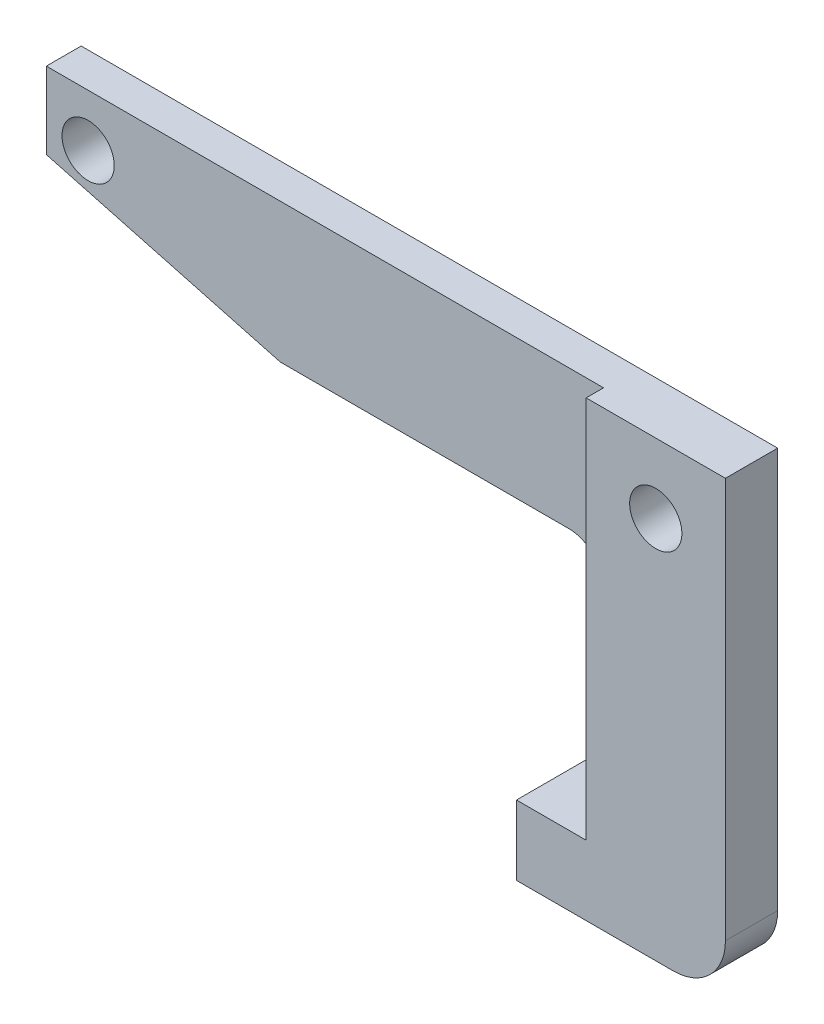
ISO-10303-21;
HEADER;
FILE_DESCRIPTION(('STEP AP214'),'2;1');
FILE_NAME('part.step','',(''),(''),'','','');
FILE_SCHEMA(('AUTOMOTIVE_DESIGN { 1 0 10303 214 1 1 1 1 }'));
ENDSEC;
DATA;
#1=APPLICATION_CONTEXT('core data for automotive mechanical design processes');
#2=APPLICATION_PROTOCOL_DEFINITION('international standard','automotive_design',2000,#1);
#3=PRODUCT_CONTEXT('',#1,'mechanical');
#4=PRODUCT('Part','Part','',(#3));
#5=PRODUCT_RELATED_PRODUCT_CATEGORY('part','',(#4));
#6=PRODUCT_DEFINITION_FORMATION('','',#4);
#7=PRODUCT_DEFINITION_CONTEXT('part definition',#1,'design');
#8=PRODUCT_DEFINITION('design','',#6,#7);
#9=PRODUCT_DEFINITION_SHAPE('','',#8);
#10=(LENGTH_UNIT() NAMED_UNIT(*) SI_UNIT(.MILLI.,.METRE.));
#11=(NAMED_UNIT(*) PLANE_ANGLE_UNIT() SI_UNIT($,.RADIAN.));
#12=(NAMED_UNIT(*) SI_UNIT($,.STERADIAN.) SOLID_ANGLE_UNIT());
#13=UNCERTAINTY_MEASURE_WITH_UNIT(LENGTH_MEASURE(1.E-05),#10,'distance_accuracy_value','');
#14=(GEOMETRIC_REPRESENTATION_CONTEXT(3) GLOBAL_UNCERTAINTY_ASSIGNED_CONTEXT((#13)) GLOBAL_UNIT_ASSIGNED_CONTEXT((#10,
#11,#12)) REPRESENTATION_CONTEXT('',''));
#15=CARTESIAN_POINT('',(0.,0.,0.));
#16=DIRECTION('',(0.,0.,1.));
#17=DIRECTION('',(1.,0.,0.));
#18=AXIS2_PLACEMENT_3D('',#15,#16,#17);
#19=CARTESIAN_POINT('',(-114.3,-12.7,0.));
#20=DIRECTION('',(0.,0.,1.));
#21=DIRECTION('',(1.,0.,0.));
#22=AXIS2_PLACEMENT_3D('',#19,#20,#21);
#23=PLANE('',#22);
#24=DIRECTION('',(0.,-1.,0.));
#25=VECTOR('',#24,1.);
#26=CARTESIAN_POINT('',(9.52499999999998,-12.7,0.));
#27=LINE('',#26,#25);
#28=CARTESIAN_POINT('',(9.52499999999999,9.52499999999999,0.));
#29=VERTEX_POINT('',#28);
#30=CARTESIAN_POINT('',(9.52499999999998,0.,0.));
#31=VERTEX_POINT('',#30);
#32=EDGE_CURVE('E153',#29,#31,#27,.T.);
#33=ORIENTED_EDGE('',*,*,#32,.T.);
#34=CARTESIAN_POINT('',(0.,0.,0.));
#35=DIRECTION('',(0.,0.,-1.));
#36=DIRECTION('',(-1.,0.,0.));
#37=AXIS2_PLACEMENT_3D('',#34,#35,#36);
#38=CIRCLE('',#37,9.525);
#39=CARTESIAN_POINT('',(0.,9.52499999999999,0.));
#40=VERTEX_POINT('',#39);
#41=EDGE_CURVE('E47',#40,#31,#38,.T.);
#42=ORIENTED_EDGE('',*,*,#41,.F.);
#43=DIRECTION('',(1.,0.,0.));
#44=VECTOR('',#43,1.);
#45=CARTESIAN_POINT('',(-114.3,9.52499999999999,0.));
#46=LINE('',#45,#44);
#47=EDGE_CURVE('E150',#40,#29,#46,.T.);
#48=ORIENTED_EDGE('',*,*,#47,.T.);
#49=EDGE_LOOP('',(#33,#42,#48));
#50=FACE_BOUND('',#49,.T.);
#51=ADVANCED_FACE('F32',(#50),#23,.F.);
#52=CARTESIAN_POINT('',(0.,0.,0.));
#53=DIRECTION('',(0.,0.,1.));
#54=DIRECTION('',(1.,0.,0.));
#55=AXIS2_PLACEMENT_3D('',#52,#53,#54);
#56=CYLINDRICAL_SURFACE('',#55,4.7625);
#57=CARTESIAN_POINT('',(0.,0.,12.7));
#58=DIRECTION('',(0.,0.,1.));
#59=DIRECTION('',(1.,0.,0.));
#60=AXIS2_PLACEMENT_3D('',#57,#58,#59);
#61=CIRCLE('',#60,4.7625);
#62=CARTESIAN_POINT('',(4.7625,0.,12.7));
#63=VERTEX_POINT('',#62);
#64=EDGE_CURVE('E213',#63,#63,#61,.T.);
#65=ORIENTED_EDGE('',*,*,#64,.T.);
#66=EDGE_LOOP('',(#65));
#67=FACE_BOUND('',#66,.T.);
#68=CARTESIAN_POINT('',(0.,0.,4.445));
#69=DIRECTION('',(0.,0.,-1.));
#70=DIRECTION('',(-1.,0.,0.));
#71=AXIS2_PLACEMENT_3D('',#68,#69,#70);
#72=CIRCLE('',#71,4.7625);
#73=CARTESIAN_POINT('',(-4.7625,0.,4.445));
#74=VERTEX_POINT('',#73);
#75=EDGE_CURVE('E36',#74,#74,#72,.F.);
#76=ORIENTED_EDGE('',*,*,#75,.F.);
#77=EDGE_LOOP('',(#76));
#78=FACE_BOUND('',#77,.T.);
#79=ADVANCED_FACE('F308',(#67,#78),#56,.F.);
#80=CARTESIAN_POINT('',(-114.3,12.7,12.7));
#81=DIRECTION('',(1.,0.,0.));
#82=DIRECTION('',(0.,0.,-1.));
#83=AXIS2_PLACEMENT_3D('',#80,#81,#82);
#84=PLANE('',#83);
#85=DIRECTION('',(0.,0.,-1.));
#86=VECTOR('',#85,1.);
#87=CARTESIAN_POINT('',(-114.3,12.7,12.7));
#88=LINE('',#87,#86);
#89=CARTESIAN_POINT('',(-114.3,12.7,9.525));
#90=VERTEX_POINT('',#89);
#91=CARTESIAN_POINT('',(-114.3,12.7,3.175));
#92=VERTEX_POINT('',#91);
#93=EDGE_CURVE('E182',#90,#92,#88,.T.);
#94=ORIENTED_EDGE('',*,*,#93,.T.);
#95=DIRECTION('',(0.,0.707106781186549,0.707106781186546));
#96=VECTOR('',#95,1.);
#97=CARTESIAN_POINT('',(-114.3,12.7,3.175));
#98=LINE('',#97,#96);
#99=CARTESIAN_POINT('',(-114.3,9.52499999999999,0.));
#100=VERTEX_POINT('',#99);
#101=EDGE_CURVE('E41',#92,#100,#98,.F.);
#102=ORIENTED_EDGE('',*,*,#101,.T.);
#103=DIRECTION('',(0.,-1.,0.));
#104=VECTOR('',#103,1.);
#105=CARTESIAN_POINT('',(-114.3,12.7,0.));
#106=LINE('',#105,#104);
#107=CARTESIAN_POINT('',(-114.3,-1.26999999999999,0.));
#108=VERTEX_POINT('',#107);
#109=EDGE_CURVE('E166',#100,#108,#106,.T.);
#110=ORIENTED_EDGE('',*,*,#109,.T.);
#111=DIRECTION('',(0.,0.,1.));
#112=VECTOR('',#111,1.);
#113=CARTESIAN_POINT('',(-114.3,-1.26999999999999,12.7));
#114=LINE('',#113,#112);
#115=CARTESIAN_POINT('',(-114.3,-1.26999999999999,9.525));
#116=VERTEX_POINT('',#115);
#117=EDGE_CURVE('E257',#108,#116,#114,.T.);
#118=ORIENTED_EDGE('',*,*,#117,.T.);
#119=DIRECTION('',(0.,-1.,0.));
#120=VECTOR('',#119,1.);
#121=CARTESIAN_POINT('',(-114.3,-12.7,9.525));
#122=LINE('',#121,#120);
#123=EDGE_CURVE('E199',#90,#116,#122,.T.);
#124=ORIENTED_EDGE('',*,*,#123,.F.);
#125=EDGE_LOOP('',(#94,#102,#110,#118,#124));
#126=FACE_BOUND('',#125,.T.);
#127=ADVANCED_FACE('F34',(#126),#84,.F.);
#128=CARTESIAN_POINT('',(-114.3,-12.7,12.7));
#129=DIRECTION('',(0.,1.,0.));
#130=DIRECTION('',(0.,0.,1.));
#131=AXIS2_PLACEMENT_3D('',#128,#129,#130);
#132=PLANE('',#131);
#133=DIRECTION('',(1.,0.,0.));
#134=VECTOR('',#133,1.);
#135=CARTESIAN_POINT('',(-114.3,-12.7,0.));
#136=LINE('',#135,#134);
#137=CARTESIAN_POINT('',(-71.6426592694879,-12.7,0.));
#138=VERTEX_POINT('',#137);
#139=CARTESIAN_POINT('',(-19.05,-12.7,0.));
#140=VERTEX_POINT('',#139);
#141=EDGE_CURVE('E217',#138,#140,#136,.T.);
#142=ORIENTED_EDGE('',*,*,#141,.T.);
#143=DIRECTION('',(0.,0.,-1.));
#144=VECTOR('',#143,1.);
#145=CARTESIAN_POINT('',(-19.05,-12.7,9.525));
#146=LINE('',#145,#144);
#147=CARTESIAN_POINT('',(-19.05,-12.7,9.525));
#148=VERTEX_POINT('',#147);
#149=EDGE_CURVE('E272',#140,#148,#146,.F.);
#150=ORIENTED_EDGE('',*,*,#149,.T.);
#151=DIRECTION('',(1.,0.,0.));
#152=VECTOR('',#151,1.);
#153=CARTESIAN_POINT('',(-12.7,-12.7,9.525));
#154=LINE('',#153,#152);
#155=CARTESIAN_POINT('',(-71.642659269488,-12.7,9.525));
#156=VERTEX_POINT('',#155);
#157=EDGE_CURVE('E201',#156,#148,#154,.T.);
#158=ORIENTED_EDGE('',*,*,#157,.F.);
#159=DIRECTION('',(0.,0.,-1.));
#160=VECTOR('',#159,1.);
#161=CARTESIAN_POINT('',(-71.6426592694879,-12.7,12.7));
#162=LINE('',#161,#160);
#163=EDGE_CURVE('E253',#156,#138,#162,.T.);
#164=ORIENTED_EDGE('',*,*,#163,.T.);
#165=EDGE_LOOP('',(#142,#150,#158,#164));
#166=FACE_BOUND('',#165,.T.);
#167=ADVANCED_FACE('F335',(#166),#132,.F.);
#168=CARTESIAN_POINT('',(-106.68,3.175,0.));
#169=DIRECTION('',(0.,0.,1.));
#170=DIRECTION('',(1.,0.,0.));
#171=AXIS2_PLACEMENT_3D('',#168,#169,#170);
#172=CYLINDRICAL_SURFACE('',#171,4.7625);
#173=CARTESIAN_POINT('',(-106.68,3.175,0.));
#174=DIRECTION('',(0.,0.,1.));
#175=DIRECTION('',(1.,0.,0.));
#176=AXIS2_PLACEMENT_3D('',#173,#174,#175);
#177=CIRCLE('',#176,4.7625);
#178=CARTESIAN_POINT('',(-101.9175,3.175,0.));
#179=VERTEX_POINT('',#178);
#180=EDGE_CURVE('E210',#179,#179,#177,.T.);
#181=ORIENTED_EDGE('',*,*,#180,.F.);
#182=EDGE_LOOP('',(#181));
#183=FACE_BOUND('',#182,.T.);
#184=CARTESIAN_POINT('',(-106.68,3.175,9.525));
#185=DIRECTION('',(0.,0.,1.));
#186=DIRECTION('',(1.,0.,0.));
#187=AXIS2_PLACEMENT_3D('',#184,#185,#186);
#188=CIRCLE('',#187,4.7625);
#189=CARTESIAN_POINT('',(-101.9175,3.175,9.525));
#190=VERTEX_POINT('',#189);
#191=EDGE_CURVE('E207',#190,#190,#188,.F.);
#192=ORIENTED_EDGE('',*,*,#191,.F.);
#193=EDGE_LOOP('',(#192));
#194=FACE_BOUND('',#193,.T.);
#195=ADVANCED_FACE('F331',(#183,#194),#172,.F.);
#196=CARTESIAN_POINT('',(-71.6426592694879,-12.7,12.7));
#197=DIRECTION('',(0.258819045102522,0.965925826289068,0.));
#198=DIRECTION('',(-0.965925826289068,0.258819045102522,0.));
#199=AXIS2_PLACEMENT_3D('',#196,#197,#198);
#200=PLANE('',#199);
#201=ORIENTED_EDGE('',*,*,#163,.F.);
#202=DIRECTION('',(0.965925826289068,-0.258819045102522,0.));
#203=VECTOR('',#202,1.);
#204=CARTESIAN_POINT('',(-71.6426592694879,-12.7,9.525));
#205=LINE('',#204,#203);
#206=EDGE_CURVE('E259',#156,#116,#205,.F.);
#207=ORIENTED_EDGE('',*,*,#206,.T.);
#208=ORIENTED_EDGE('',*,*,#117,.F.);
#209=DIRECTION('',(0.965925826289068,-0.258819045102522,0.));
#210=VECTOR('',#209,1.);
#211=CARTESIAN_POINT('',(-71.6426592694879,-12.7,0.));
#212=LINE('',#211,#210);
#213=EDGE_CURVE('E255',#138,#108,#212,.F.);
#214=ORIENTED_EDGE('',*,*,#213,.F.);
#215=EDGE_LOOP('',(#201,#207,#208,#214));
#216=FACE_BOUND('',#215,.T.);
#217=ADVANCED_FACE('F334',(#216),#200,.F.);
#218=CARTESIAN_POINT('',(-12.7,-12.7,12.7));
#219=DIRECTION('',(1.,0.,0.));
#220=DIRECTION('',(0.,1.,0.));
#221=AXIS2_PLACEMENT_3D('',#218,#219,#220);
#222=PLANE('',#221);
#223=DIRECTION('',(0.,1.,0.));
#224=VECTOR('',#223,1.);
#225=CARTESIAN_POINT('',(-12.7,-12.7,9.525));
#226=LINE('',#225,#224);
#227=CARTESIAN_POINT('',(-12.7,-19.05,9.525));
#228=VERTEX_POINT('',#227);
#229=CARTESIAN_POINT('',(-12.7,12.7,9.525));
#230=VERTEX_POINT('',#229);
#231=EDGE_CURVE('E188',#228,#230,#226,.T.);
#232=ORIENTED_EDGE('',*,*,#231,.F.);
#233=DIRECTION('',(0.,0.,-1.));
#234=VECTOR('',#233,1.);
#235=CARTESIAN_POINT('',(-12.7,-19.05,0.));
#236=LINE('',#235,#234);
#237=CARTESIAN_POINT('',(-12.7,-19.05,0.));
#238=VERTEX_POINT('',#237);
#239=EDGE_CURVE('E269',#228,#238,#236,.T.);
#240=ORIENTED_EDGE('',*,*,#239,.T.);
#241=DIRECTION('',(0.,-1.,0.));
#242=VECTOR('',#241,1.);
#243=CARTESIAN_POINT('',(-12.7,-12.7,0.));
#244=LINE('',#243,#242);
#245=CARTESIAN_POINT('',(-12.7,-57.15,0.));
#246=VERTEX_POINT('',#245);
#247=EDGE_CURVE('E220',#238,#246,#244,.T.);
#248=ORIENTED_EDGE('',*,*,#247,.T.);
#249=DIRECTION('',(0.,0.,-1.));
#250=VECTOR('',#249,1.);
#251=CARTESIAN_POINT('',(-12.7,-57.15,12.7));
#252=LINE('',#251,#250);
#253=CARTESIAN_POINT('',(-12.7,-57.15,12.7));
#254=VERTEX_POINT('',#253);
#255=EDGE_CURVE('E250',#254,#246,#252,.T.);
#256=ORIENTED_EDGE('',*,*,#255,.F.);
#257=DIRECTION('',(0.,-1.,0.));
#258=VECTOR('',#257,1.);
#259=CARTESIAN_POINT('',(-12.7,-12.7,12.7));
#260=LINE('',#259,#258);
#261=CARTESIAN_POINT('',(-12.7,12.7,12.7));
#262=VERTEX_POINT('',#261);
#263=EDGE_CURVE('E227',#262,#254,#260,.T.);
#264=ORIENTED_EDGE('',*,*,#263,.F.);
#265=DIRECTION('',(0.,0.,1.));
#266=VECTOR('',#265,1.);
#267=CARTESIAN_POINT('',(-12.7,12.7,9.525));
#268=LINE('',#267,#266);
#269=EDGE_CURVE('E204',#230,#262,#268,.T.);
#270=ORIENTED_EDGE('',*,*,#269,.F.);
#271=EDGE_LOOP('',(#232,#240,#248,#256,#264,#270));
#272=FACE_BOUND('',#271,.T.);
#273=ADVANCED_FACE('F343',(#272),#222,.F.);
#274=CARTESIAN_POINT('',(-12.7,-57.15,12.7));
#275=DIRECTION('',(0.,-1.,0.));
#276=DIRECTION('',(0.,0.,-1.));
#277=AXIS2_PLACEMENT_3D('',#274,#275,#276);
#278=PLANE('',#277);
#279=DIRECTION('',(-1.,0.,0.));
#280=VECTOR('',#279,1.);
#281=CARTESIAN_POINT('',(-12.7,-57.15,0.));
#282=LINE('',#281,#280);
#283=CARTESIAN_POINT('',(-25.4,-57.15,0.));
#284=VERTEX_POINT('',#283);
#285=EDGE_CURVE('E222',#246,#284,#282,.T.);
#286=ORIENTED_EDGE('',*,*,#285,.T.);
#287=DIRECTION('',(0.,0.,-1.));
#288=VECTOR('',#287,1.);
#289=CARTESIAN_POINT('',(-25.4,-57.15,12.7));
#290=LINE('',#289,#288);
#291=CARTESIAN_POINT('',(-25.4,-57.15,12.7));
#292=VERTEX_POINT('',#291);
#293=EDGE_CURVE('E247',#292,#284,#290,.T.);
#294=ORIENTED_EDGE('',*,*,#293,.F.);
#295=DIRECTION('',(-1.,0.,0.));
#296=VECTOR('',#295,1.);
#297=CARTESIAN_POINT('',(-12.7,-57.15,12.7));
#298=LINE('',#297,#296);
#299=EDGE_CURVE('E229',#254,#292,#298,.T.);
#300=ORIENTED_EDGE('',*,*,#299,.F.);
#301=ORIENTED_EDGE('',*,*,#255,.T.);
#302=EDGE_LOOP('',(#286,#294,#300,#301));
#303=FACE_BOUND('',#302,.T.);
#304=ADVANCED_FACE('F391',(#303),#278,.F.);
#305=CARTESIAN_POINT('',(-25.4,-57.15,12.7));
#306=DIRECTION('',(1.,0.,0.));
#307=DIRECTION('',(0.,1.,0.));
#308=AXIS2_PLACEMENT_3D('',#305,#306,#307);
#309=PLANE('',#308);
#310=DIRECTION('',(0.,-1.,0.));
#311=VECTOR('',#310,1.);
#312=CARTESIAN_POINT('',(-25.4,-57.15,0.));
#313=LINE('',#312,#311);
#314=CARTESIAN_POINT('',(-25.4,-66.675,0.));
#315=VERTEX_POINT('',#314);
#316=EDGE_CURVE('E224',#284,#315,#313,.T.);
#317=ORIENTED_EDGE('',*,*,#316,.T.);
#318=DIRECTION('',(0.,0.707106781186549,-0.707106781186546));
#319=VECTOR('',#318,1.);
#320=CARTESIAN_POINT('',(-25.4,-69.85,3.175));
#321=LINE('',#320,#319);
#322=CARTESIAN_POINT('',(-25.4,-69.85,3.175));
#323=VERTEX_POINT('',#322);
#324=EDGE_CURVE('E174',#315,#323,#321,.F.);
#325=ORIENTED_EDGE('',*,*,#324,.T.);
#326=DIRECTION('',(0.,0.,-1.));
#327=VECTOR('',#326,1.);
#328=CARTESIAN_POINT('',(-25.4,-69.85,12.7));
#329=LINE('',#328,#327);
#330=CARTESIAN_POINT('',(-25.4,-69.85,12.7));
#331=VERTEX_POINT('',#330);
#332=EDGE_CURVE('E244',#331,#323,#329,.T.);
#333=ORIENTED_EDGE('',*,*,#332,.F.);
#334=DIRECTION('',(0.,-1.,0.));
#335=VECTOR('',#334,1.);
#336=CARTESIAN_POINT('',(-25.4,-57.15,12.7));
#337=LINE('',#336,#335);
#338=EDGE_CURVE('E231',#292,#331,#337,.T.);
#339=ORIENTED_EDGE('',*,*,#338,.F.);
#340=ORIENTED_EDGE('',*,*,#293,.T.);
#341=EDGE_LOOP('',(#317,#325,#333,#339,#340));
#342=FACE_BOUND('',#341,.T.);
#343=ADVANCED_FACE('F366',(#342),#309,.F.);
#344=CARTESIAN_POINT('',(12.7,-69.85,12.7));
#345=DIRECTION('',(0.,1.,0.));
#346=DIRECTION('',(-1.,0.,0.));
#347=AXIS2_PLACEMENT_3D('',#344,#345,#346);
#348=PLANE('',#347);
#349=ORIENTED_EDGE('',*,*,#332,.T.);
#350=DIRECTION('',(1.,0.,0.));
#351=VECTOR('',#350,1.);
#352=CARTESIAN_POINT('',(12.7,-69.85,3.175));
#353=LINE('',#352,#351);
#354=CARTESIAN_POINT('',(3.17500000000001,-69.85,3.175));
#355=VERTEX_POINT('',#354);
#356=EDGE_CURVE('E278',#323,#355,#353,.T.);
#357=ORIENTED_EDGE('',*,*,#356,.T.);
#358=DIRECTION('',(0.,0.,-1.));
#359=VECTOR('',#358,1.);
#360=CARTESIAN_POINT('',(3.17500000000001,-69.85,12.7));
#361=LINE('',#360,#359);
#362=CARTESIAN_POINT('',(3.17500000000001,-69.85,12.7));
#363=VERTEX_POINT('',#362);
#364=EDGE_CURVE('E265',#355,#363,#361,.F.);
#365=ORIENTED_EDGE('',*,*,#364,.T.);
#366=DIRECTION('',(1.,0.,0.));
#367=VECTOR('',#366,1.);
#368=CARTESIAN_POINT('',(12.7,-69.85,12.7));
#369=LINE('',#368,#367);
#370=EDGE_CURVE('E233',#331,#363,#369,.T.);
#371=ORIENTED_EDGE('',*,*,#370,.F.);
#372=EDGE_LOOP('',(#349,#357,#365,#371));
#373=FACE_BOUND('',#372,.T.);
#374=ADVANCED_FACE('F370',(#373),#348,.F.);
#375=CARTESIAN_POINT('',(12.7,12.7,12.7));
#376=DIRECTION('',(-1.,0.,0.));
#377=DIRECTION('',(0.,-1.,0.));
#378=AXIS2_PLACEMENT_3D('',#375,#376,#377);
#379=PLANE('',#378);
#380=DIRECTION('',(0.,0.,-1.));
#381=VECTOR('',#380,1.);
#382=CARTESIAN_POINT('',(12.7,-60.325,12.7));
#383=LINE('',#382,#381);
#384=CARTESIAN_POINT('',(12.7,-60.325,12.7));
#385=VERTEX_POINT('',#384);
#386=CARTESIAN_POINT('',(12.7,-60.325,3.175));
#387=VERTEX_POINT('',#386);
#388=EDGE_CURVE('E262',#385,#387,#383,.T.);
#389=ORIENTED_EDGE('',*,*,#388,.T.);
#390=DIRECTION('',(0.,1.,0.));
#391=VECTOR('',#390,1.);
#392=CARTESIAN_POINT('',(12.7,12.7,3.175));
#393=LINE('',#392,#391);
#394=CARTESIAN_POINT('',(12.7,12.7,3.175));
#395=VERTEX_POINT('',#394);
#396=EDGE_CURVE('E11',#387,#395,#393,.T.);
#397=ORIENTED_EDGE('',*,*,#396,.T.);
#398=DIRECTION('',(0.,0.,-1.));
#399=VECTOR('',#398,1.);
#400=CARTESIAN_POINT('',(12.7,12.7,12.7));
#401=LINE('',#400,#399);
#402=CARTESIAN_POINT('',(12.7,12.7,12.7));
#403=VERTEX_POINT('',#402);
#404=EDGE_CURVE('E242',#403,#395,#401,.T.);
#405=ORIENTED_EDGE('',*,*,#404,.F.);
#406=DIRECTION('',(0.,1.,0.));
#407=VECTOR('',#406,1.);
#408=CARTESIAN_POINT('',(12.7,12.7,12.7));
#409=LINE('',#408,#407);
#410=EDGE_CURVE('E236',#385,#403,#409,.T.);
#411=ORIENTED_EDGE('',*,*,#410,.F.);
#412=EDGE_LOOP('',(#389,#397,#405,#411));
#413=FACE_BOUND('',#412,.T.);
#414=ADVANCED_FACE('F376',(#413),#379,.F.);
#415=CARTESIAN_POINT('',(-114.3,12.7,12.7));
#416=DIRECTION('',(0.,-1.,0.));
#417=DIRECTION('',(0.,0.,-1.));
#418=AXIS2_PLACEMENT_3D('',#415,#416,#417);
#419=PLANE('',#418);
#420=ORIENTED_EDGE('',*,*,#404,.T.);
#421=DIRECTION('',(-1.,0.,0.));
#422=VECTOR('',#421,1.);
#423=CARTESIAN_POINT('',(-114.3,12.7,3.175));
#424=LINE('',#423,#422);
#425=EDGE_CURVE('E55',#395,#92,#424,.T.);
#426=ORIENTED_EDGE('',*,*,#425,.T.);
#427=ORIENTED_EDGE('',*,*,#93,.F.);
#428=DIRECTION('',(-1.,0.,0.));
#429=VECTOR('',#428,1.);
#430=CARTESIAN_POINT('',(-12.7,12.7,9.525));
#431=LINE('',#430,#429);
#432=EDGE_CURVE('E192',#230,#90,#431,.T.);
#433=ORIENTED_EDGE('',*,*,#432,.F.);
#434=ORIENTED_EDGE('',*,*,#269,.T.);
#435=DIRECTION('',(-1.,0.,0.));
#436=VECTOR('',#435,1.);
#437=CARTESIAN_POINT('',(-114.3,12.7,12.7));
#438=LINE('',#437,#436);
#439=EDGE_CURVE('E238',#403,#262,#438,.T.);
#440=ORIENTED_EDGE('',*,*,#439,.F.);
#441=EDGE_LOOP('',(#420,#426,#427,#433,#434,#440));
#442=FACE_BOUND('',#441,.T.);
#443=ADVANCED_FACE('F327',(#442),#419,.F.);
#444=CARTESIAN_POINT('',(-114.3,-12.7,12.7));
#445=DIRECTION('',(0.,0.,1.));
#446=DIRECTION('',(1.,0.,0.));
#447=AXIS2_PLACEMENT_3D('',#444,#445,#446);
#448=PLANE('',#447);
#449=ORIENTED_EDGE('',*,*,#370,.T.);
#450=CARTESIAN_POINT('',(3.17500000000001,-60.325,12.7));
#451=DIRECTION('',(0.,0.,1.));
#452=DIRECTION('',(1.,0.,0.));
#453=AXIS2_PLACEMENT_3D('',#450,#451,#452);
#454=CIRCLE('',#453,9.525);
#455=EDGE_CURVE('E267',#363,#385,#454,.T.);
#456=ORIENTED_EDGE('',*,*,#455,.T.);
#457=ORIENTED_EDGE('',*,*,#410,.T.);
#458=ORIENTED_EDGE('',*,*,#439,.T.);
#459=ORIENTED_EDGE('',*,*,#263,.T.);
#460=ORIENTED_EDGE('',*,*,#299,.T.);
#461=ORIENTED_EDGE('',*,*,#338,.T.);
#462=EDGE_LOOP('',(#449,#456,#457,#458,#459,#460,#461));
#463=FACE_BOUND('',#462,.T.);
#464=ORIENTED_EDGE('',*,*,#64,.F.);
#465=EDGE_LOOP('',(#464));
#466=FACE_BOUND('',#465,.T.);
#467=ADVANCED_FACE('F318',(#463,#466),#448,.T.);
#468=ORIENTED_EDGE('',*,*,#180,.T.);
#469=EDGE_LOOP('',(#468));
#470=FACE_BOUND('',#469,.T.);
#471=EDGE_CURVE('E159',#100,#40,#46,.T.);
#472=ORIENTED_EDGE('',*,*,#471,.T.);
#473=EDGE_CURVE('E141',#31,#40,#38,.T.);
#474=ORIENTED_EDGE('',*,*,#473,.F.);
#475=CARTESIAN_POINT('',(9.525,-60.325,0.));
#476=VERTEX_POINT('',#475);
#477=EDGE_CURVE('E280',#31,#476,#27,.T.);
#478=ORIENTED_EDGE('',*,*,#477,.T.);
#479=CARTESIAN_POINT('',(3.17500000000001,-60.325,0.));
#480=DIRECTION('',(0.,0.,1.));
#481=DIRECTION('',(1.,0.,0.));
#482=AXIS2_PLACEMENT_3D('',#479,#480,#481);
#483=CIRCLE('',#482,6.34999999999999);
#484=CARTESIAN_POINT('',(3.17500000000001,-66.675,0.));
#485=VERTEX_POINT('',#484);
#486=EDGE_CURVE('E167',#476,#485,#483,.F.);
#487=ORIENTED_EDGE('',*,*,#486,.T.);
#488=DIRECTION('',(-1.,0.,0.));
#489=VECTOR('',#488,1.);
#490=CARTESIAN_POINT('',(-114.3,-66.675,0.));
#491=LINE('',#490,#489);
#492=EDGE_CURVE('E168',#485,#315,#491,.T.);
#493=ORIENTED_EDGE('',*,*,#492,.T.);
#494=ORIENTED_EDGE('',*,*,#316,.F.);
#495=ORIENTED_EDGE('',*,*,#285,.F.);
#496=ORIENTED_EDGE('',*,*,#247,.F.);
#497=CARTESIAN_POINT('',(-19.05,-19.05,0.));
#498=DIRECTION('',(0.,0.,1.));
#499=DIRECTION('',(1.,0.,0.));
#500=AXIS2_PLACEMENT_3D('',#497,#498,#499);
#501=CIRCLE('',#500,6.35);
#502=EDGE_CURVE('E274',#238,#140,#501,.T.);
#503=ORIENTED_EDGE('',*,*,#502,.T.);
#504=ORIENTED_EDGE('',*,*,#141,.F.);
#505=ORIENTED_EDGE('',*,*,#213,.T.);
#506=ORIENTED_EDGE('',*,*,#109,.F.);
#507=EDGE_LOOP('',(#472,#474,#478,#487,#493,#494,#495,#496,#503,#504,#505,#506));
#508=FACE_BOUND('',#507,.T.);
#509=ADVANCED_FACE('F164',(#470,#508),#23,.F.);
#510=CARTESIAN_POINT('',(-12.7,12.7,9.525));
#511=DIRECTION('',(0.,0.,1.));
#512=DIRECTION('',(1.,0.,0.));
#513=AXIS2_PLACEMENT_3D('',#510,#511,#512);
#514=PLANE('',#513);
#515=ORIENTED_EDGE('',*,*,#157,.T.);
#516=CARTESIAN_POINT('',(-19.05,-19.05,9.525));
#517=DIRECTION('',(0.,0.,1.));
#518=DIRECTION('',(1.,0.,0.));
#519=AXIS2_PLACEMENT_3D('',#516,#517,#518);
#520=CIRCLE('',#519,6.35);
#521=EDGE_CURVE('E276',#148,#228,#520,.F.);
#522=ORIENTED_EDGE('',*,*,#521,.T.);
#523=ORIENTED_EDGE('',*,*,#231,.T.);
#524=ORIENTED_EDGE('',*,*,#432,.T.);
#525=ORIENTED_EDGE('',*,*,#123,.T.);
#526=ORIENTED_EDGE('',*,*,#206,.F.);
#527=EDGE_LOOP('',(#515,#522,#523,#524,#525,#526));
#528=FACE_BOUND('',#527,.T.);
#529=ORIENTED_EDGE('',*,*,#191,.T.);
#530=EDGE_LOOP('',(#529));
#531=FACE_BOUND('',#530,.T.);
#532=ADVANCED_FACE('F317',(#528,#531),#514,.T.);
#533=CARTESIAN_POINT('',(3.17500000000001,-60.325,12.7));
#534=DIRECTION('',(0.,0.,-1.));
#535=DIRECTION('',(-1.,0.,0.));
#536=AXIS2_PLACEMENT_3D('',#533,#534,#535);
#537=CYLINDRICAL_SURFACE('',#536,9.525);
#538=ORIENTED_EDGE('',*,*,#364,.F.);
#539=CARTESIAN_POINT('',(3.17500000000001,-60.325,3.175));
#540=DIRECTION('',(0.,0.,1.));
#541=DIRECTION('',(1.,0.,0.));
#542=AXIS2_PLACEMENT_3D('',#539,#540,#541);
#543=CIRCLE('',#542,9.525);
#544=EDGE_CURVE('E176',#355,#387,#543,.T.);
#545=ORIENTED_EDGE('',*,*,#544,.T.);
#546=ORIENTED_EDGE('',*,*,#388,.F.);
#547=ORIENTED_EDGE('',*,*,#455,.F.);
#548=EDGE_LOOP('',(#538,#545,#546,#547));
#549=FACE_BOUND('',#548,.T.);
#550=ADVANCED_FACE('F324',(#549),#537,.T.);
#551=CARTESIAN_POINT('',(-19.05,-19.05,12.7));
#552=DIRECTION('',(0.,0.,1.));
#553=DIRECTION('',(1.,0.,0.));
#554=AXIS2_PLACEMENT_3D('',#551,#552,#553);
#555=CYLINDRICAL_SURFACE('',#554,6.35);
#556=ORIENTED_EDGE('',*,*,#521,.F.);
#557=ORIENTED_EDGE('',*,*,#149,.F.);
#558=ORIENTED_EDGE('',*,*,#502,.F.);
#559=ORIENTED_EDGE('',*,*,#239,.F.);
#560=EDGE_LOOP('',(#556,#557,#558,#559));
#561=FACE_BOUND('',#560,.T.);
#562=ADVANCED_FACE('F350',(#561),#555,.F.);
#563=CARTESIAN_POINT('',(-114.3,12.7,3.175));
#564=DIRECTION('',(0.,-0.707106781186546,0.707106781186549));
#565=DIRECTION('',(0.,-0.707106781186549,-0.707106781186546));
#566=AXIS2_PLACEMENT_3D('',#563,#564,#565);
#567=PLANE('',#566);
#568=ORIENTED_EDGE('',*,*,#101,.F.);
#569=ORIENTED_EDGE('',*,*,#425,.F.);
#570=DIRECTION('',(0.577350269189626,0.577350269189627,0.577350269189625));
#571=VECTOR('',#570,1.);
#572=CARTESIAN_POINT('',(12.7,12.7,3.175));
#573=LINE('',#572,#571);
#574=EDGE_CURVE('E161',#29,#395,#573,.T.);
#575=ORIENTED_EDGE('',*,*,#574,.F.);
#576=ORIENTED_EDGE('',*,*,#47,.F.);
#577=ORIENTED_EDGE('',*,*,#471,.F.);
#578=EDGE_LOOP('',(#568,#569,#575,#576,#577));
#579=FACE_BOUND('',#578,.T.);
#580=ADVANCED_FACE('F158',(#579),#567,.F.);
#581=CARTESIAN_POINT('',(12.7,12.7,3.175));
#582=DIRECTION('',(-0.707106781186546,0.,0.707106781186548));
#583=DIRECTION('',(0.707106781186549,0.,0.707106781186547));
#584=AXIS2_PLACEMENT_3D('',#581,#582,#583);
#585=PLANE('',#584);
#586=ORIENTED_EDGE('',*,*,#574,.T.);
#587=ORIENTED_EDGE('',*,*,#396,.F.);
#588=DIRECTION('',(0.707106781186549,0.,0.707106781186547));
#589=VECTOR('',#588,1.);
#590=CARTESIAN_POINT('',(9.525,-60.325,0.));
#591=LINE('',#590,#589);
#592=EDGE_CURVE('E189',#476,#387,#591,.T.);
#593=ORIENTED_EDGE('',*,*,#592,.F.);
#594=ORIENTED_EDGE('',*,*,#477,.F.);
#595=ORIENTED_EDGE('',*,*,#32,.F.);
#596=EDGE_LOOP('',(#586,#587,#593,#594,#595));
#597=FACE_BOUND('',#596,.T.);
#598=ADVANCED_FACE('F185',(#597),#585,.F.);
#599=CARTESIAN_POINT('',(3.17500000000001,-60.325,0.));
#600=DIRECTION('',(0.,0.,1.));
#601=DIRECTION('',(1.,0.,0.));
#602=AXIS2_PLACEMENT_3D('',#599,#600,#601);
#603=CONICAL_SURFACE('',#602,6.34999999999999,0.78539816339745);
#604=ORIENTED_EDGE('',*,*,#592,.T.);
#605=ORIENTED_EDGE('',*,*,#544,.F.);
#606=DIRECTION('',(0.,-0.707106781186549,0.707106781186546));
#607=VECTOR('',#606,1.);
#608=CARTESIAN_POINT('',(3.17500000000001,-66.675,0.));
#609=LINE('',#608,#607);
#610=EDGE_CURVE('E194',#485,#355,#609,.T.);
#611=ORIENTED_EDGE('',*,*,#610,.F.);
#612=ORIENTED_EDGE('',*,*,#486,.F.);
#613=EDGE_LOOP('',(#604,#605,#611,#612));
#614=FACE_BOUND('',#613,.T.);
#615=ADVANCED_FACE('F289',(#614),#603,.T.);
#616=CARTESIAN_POINT('',(12.7,-69.85,3.175));
#617=DIRECTION('',(0.,0.707106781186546,0.707106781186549));
#618=DIRECTION('',(0.,-0.707106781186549,0.707106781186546));
#619=AXIS2_PLACEMENT_3D('',#616,#617,#618);
#620=PLANE('',#619);
#621=ORIENTED_EDGE('',*,*,#324,.F.);
#622=ORIENTED_EDGE('',*,*,#492,.F.);
#623=ORIENTED_EDGE('',*,*,#610,.T.);
#624=ORIENTED_EDGE('',*,*,#356,.F.);
#625=EDGE_LOOP('',(#621,#622,#623,#624));
#626=FACE_BOUND('',#625,.T.);
#627=ADVANCED_FACE('F304',(#626),#620,.F.);
#628=CARTESIAN_POINT('',(0.,0.,4.445));
#629=DIRECTION('',(0.,0.,-1.));
#630=DIRECTION('',(-1.,0.,0.));
#631=AXIS2_PLACEMENT_3D('',#628,#629,#630);
#632=PLANE('',#631);
#633=CARTESIAN_POINT('',(0.,0.,4.445));
#634=DIRECTION('',(0.,0.,-1.));
#635=DIRECTION('',(-1.,0.,0.));
#636=AXIS2_PLACEMENT_3D('',#633,#634,#635);
#637=CIRCLE('',#636,9.525);
#638=CARTESIAN_POINT('',(-9.525,0.,4.445));
#639=VERTEX_POINT('',#638);
#640=EDGE_CURVE('E154',#639,#639,#637,.T.);
#641=ORIENTED_EDGE('',*,*,#640,.T.);
#642=EDGE_LOOP('',(#641));
#643=FACE_BOUND('',#642,.T.);
#644=ORIENTED_EDGE('',*,*,#75,.T.);
#645=EDGE_LOOP('',(#644));
#646=FACE_BOUND('',#645,.T.);
#647=ADVANCED_FACE('F296',(#643,#646),#632,.T.);
#648=CARTESIAN_POINT('',(0.,0.,4.445));
#649=DIRECTION('',(0.,0.,-1.));
#650=DIRECTION('',(-1.,0.,0.));
#651=AXIS2_PLACEMENT_3D('',#648,#649,#650);
#652=CYLINDRICAL_SURFACE('',#651,9.525);
#653=ORIENTED_EDGE('',*,*,#640,.F.);
#654=EDGE_LOOP('',(#653));
#655=FACE_BOUND('',#654,.T.);
#656=ORIENTED_EDGE('',*,*,#41,.T.);
#657=ORIENTED_EDGE('',*,*,#473,.T.);
#658=EDGE_LOOP('',(#656,#657));
#659=FACE_BOUND('',#658,.T.);
#660=ADVANCED_FACE('F142',(#655,#659),#652,.F.);
#661=CLOSED_SHELL('',(#51,#79,#127,#167,#195,#217,#273,#304,#343,#374,#414,#443,#467,#509,#532,
#550,#562,#580,#598,#615,#627,#647,#660));
#662=MANIFOLD_SOLID_BREP('B2',#661);
#663=ADVANCED_BREP_SHAPE_REPRESENTATION('',(#18,#662),#14);
#664=SHAPE_DEFINITION_REPRESENTATION(#9,#663);
ENDSEC;
END-ISO-10303-21;
